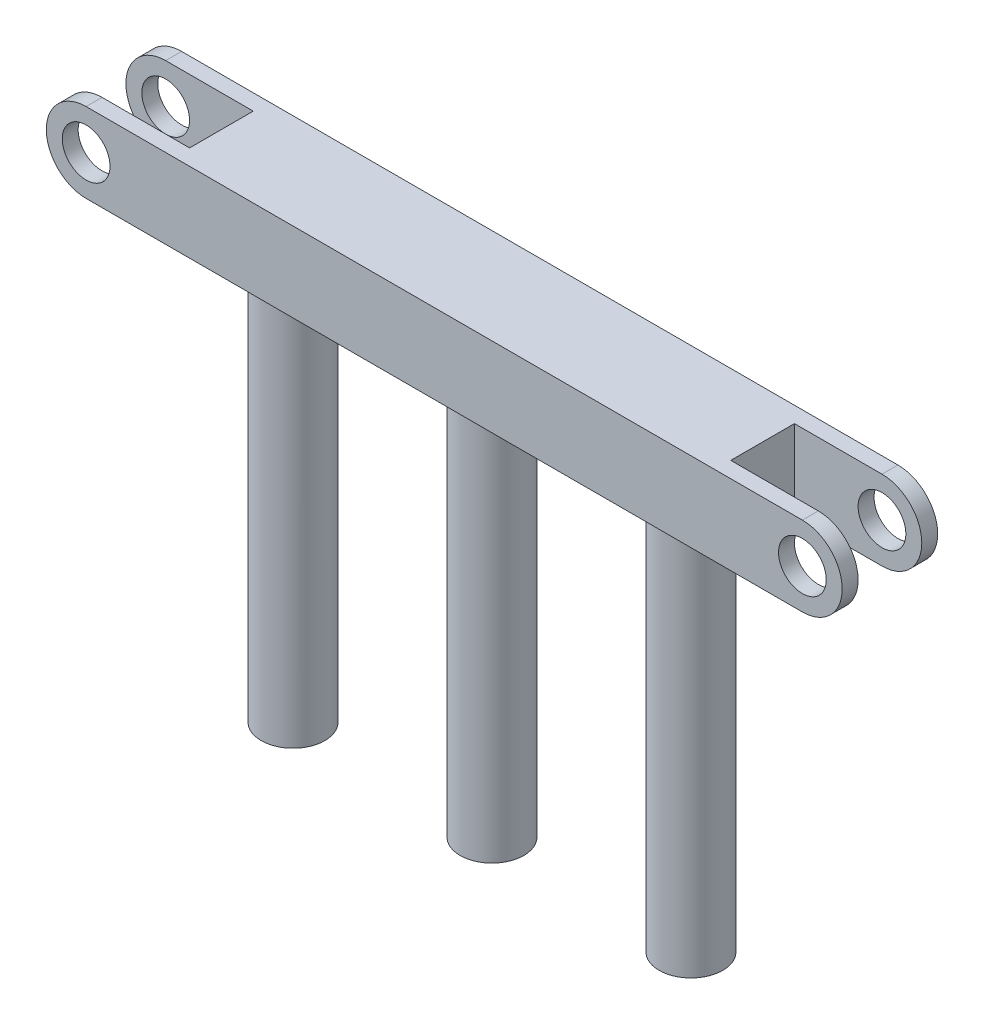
ISO-10303-21;
HEADER;
FILE_DESCRIPTION(('STEP AP214'),'2;1');
FILE_NAME('part.step','',(''),(''),'','','');
FILE_SCHEMA(('AUTOMOTIVE_DESIGN { 1 0 10303 214 1 1 1 1 }'));
ENDSEC;
DATA;
#1=APPLICATION_CONTEXT('core data for automotive mechanical design processes');
#2=APPLICATION_PROTOCOL_DEFINITION('international standard','automotive_design',2000,#1);
#3=PRODUCT_CONTEXT('',#1,'mechanical');
#4=PRODUCT('Part','Part','',(#3));
#5=PRODUCT_RELATED_PRODUCT_CATEGORY('part','',(#4));
#6=PRODUCT_DEFINITION_FORMATION('','',#4);
#7=PRODUCT_DEFINITION_CONTEXT('part definition',#1,'design');
#8=PRODUCT_DEFINITION('design','',#6,#7);
#9=PRODUCT_DEFINITION_SHAPE('','',#8);
#10=(LENGTH_UNIT() NAMED_UNIT(*) SI_UNIT(.MILLI.,.METRE.));
#11=(NAMED_UNIT(*) PLANE_ANGLE_UNIT() SI_UNIT($,.RADIAN.));
#12=(NAMED_UNIT(*) SI_UNIT($,.STERADIAN.) SOLID_ANGLE_UNIT());
#13=UNCERTAINTY_MEASURE_WITH_UNIT(LENGTH_MEASURE(1.E-05),#10,'distance_accuracy_value','');
#14=(GEOMETRIC_REPRESENTATION_CONTEXT(3) GLOBAL_UNCERTAINTY_ASSIGNED_CONTEXT((#13)) GLOBAL_UNIT_ASSIGNED_CONTEXT((#10,
#11,#12)) REPRESENTATION_CONTEXT('',''));
#15=CARTESIAN_POINT('',(0.,0.,0.));
#16=DIRECTION('',(0.,0.,1.));
#17=DIRECTION('',(1.,0.,0.));
#18=AXIS2_PLACEMENT_3D('',#15,#16,#17);
#19=CARTESIAN_POINT('',(47.5,0.,3.));
#20=DIRECTION('',(0.,0.,-1.));
#21=DIRECTION('',(-1.,0.,0.));
#22=AXIS2_PLACEMENT_3D('',#19,#20,#21);
#23=CYLINDRICAL_SURFACE('',#22,2.5);
#24=CARTESIAN_POINT('',(47.5,0.,2.));
#25=DIRECTION('',(0.,0.,1.));
#26=DIRECTION('',(1.,0.,0.));
#27=AXIS2_PLACEMENT_3D('',#24,#25,#26);
#28=CIRCLE('',#27,2.5);
#29=CARTESIAN_POINT('',(47.5,2.5,2.));
#30=VERTEX_POINT('',#29);
#31=CARTESIAN_POINT('',(47.5,-2.5,2.));
#32=VERTEX_POINT('',#31);
#33=EDGE_CURVE('E157',#30,#32,#28,.F.);
#34=ORIENTED_EDGE('',*,*,#33,.F.);
#35=DIRECTION('',(0.,0.,-1.));
#36=VECTOR('',#35,1.);
#37=CARTESIAN_POINT('',(47.5,2.5,3.));
#38=LINE('',#37,#36);
#39=CARTESIAN_POINT('',(47.5,2.5,3.));
#40=VERTEX_POINT('',#39);
#41=EDGE_CURVE('E208',#40,#30,#38,.T.);
#42=ORIENTED_EDGE('',*,*,#41,.F.);
#43=CARTESIAN_POINT('',(47.5,0.,3.));
#44=DIRECTION('',(0.,0.,1.));
#45=DIRECTION('',(1.,0.,0.));
#46=AXIS2_PLACEMENT_3D('',#43,#44,#45);
#47=CIRCLE('',#46,2.5);
#48=CARTESIAN_POINT('',(47.5,-2.5,3.));
#49=VERTEX_POINT('',#48);
#50=EDGE_CURVE('E214',#49,#40,#47,.T.);
#51=ORIENTED_EDGE('',*,*,#50,.F.);
#52=DIRECTION('',(0.,0.,-1.));
#53=VECTOR('',#52,1.);
#54=CARTESIAN_POINT('',(47.5,-2.5,3.));
#55=LINE('',#54,#53);
#56=EDGE_CURVE('E210',#32,#49,#55,.F.);
#57=ORIENTED_EDGE('',*,*,#56,.F.);
#58=EDGE_LOOP('',(#34,#42,#51,#57));
#59=FACE_BOUND('',#58,.T.);
#60=ADVANCED_FACE('F33',(#59),#23,.T.);
#61=CARTESIAN_POINT('',(47.5,0.,-3.));
#62=DIRECTION('',(0.,0.,1.));
#63=DIRECTION('',(1.,0.,0.));
#64=AXIS2_PLACEMENT_3D('',#61,#62,#63);
#65=CYLINDRICAL_SURFACE('',#64,1.5);
#66=CARTESIAN_POINT('',(47.5,0.,2.));
#67=DIRECTION('',(0.,0.,1.));
#68=DIRECTION('',(1.,0.,0.));
#69=AXIS2_PLACEMENT_3D('',#66,#67,#68);
#70=CIRCLE('',#69,1.5);
#71=CARTESIAN_POINT('',(49.,0.,2.));
#72=VERTEX_POINT('',#71);
#73=EDGE_CURVE('E37',#72,#72,#70,.F.);
#74=ORIENTED_EDGE('',*,*,#73,.T.);
#75=EDGE_LOOP('',(#74));
#76=FACE_BOUND('',#75,.T.);
#77=CARTESIAN_POINT('',(47.5,0.,3.));
#78=DIRECTION('',(0.,0.,1.));
#79=DIRECTION('',(1.,0.,0.));
#80=AXIS2_PLACEMENT_3D('',#77,#78,#79);
#81=CIRCLE('',#80,1.5);
#82=CARTESIAN_POINT('',(49.,0.,3.));
#83=VERTEX_POINT('',#82);
#84=EDGE_CURVE('E184',#83,#83,#81,.T.);
#85=ORIENTED_EDGE('',*,*,#84,.T.);
#86=EDGE_LOOP('',(#85));
#87=FACE_BOUND('',#86,.T.);
#88=ADVANCED_FACE('F249',(#76,#87),#65,.F.);
#89=CARTESIAN_POINT('',(2.5,0.,-3.));
#90=DIRECTION('',(0.,0.,-1.));
#91=DIRECTION('',(-1.,0.,0.));
#92=AXIS2_PLACEMENT_3D('',#89,#90,#91);
#93=CYLINDRICAL_SURFACE('',#92,2.5);
#94=CARTESIAN_POINT('',(2.5,0.,2.));
#95=DIRECTION('',(0.,0.,1.));
#96=DIRECTION('',(1.,0.,0.));
#97=AXIS2_PLACEMENT_3D('',#94,#95,#96);
#98=CIRCLE('',#97,2.5);
#99=CARTESIAN_POINT('',(2.5,-2.5,2.));
#100=VERTEX_POINT('',#99);
#101=CARTESIAN_POINT('',(2.5,2.5,2.));
#102=VERTEX_POINT('',#101);
#103=EDGE_CURVE('E182',#100,#102,#98,.F.);
#104=ORIENTED_EDGE('',*,*,#103,.F.);
#105=DIRECTION('',(0.,0.,-1.));
#106=VECTOR('',#105,1.);
#107=CARTESIAN_POINT('',(2.5,-2.5,3.));
#108=LINE('',#107,#106);
#109=CARTESIAN_POINT('',(2.5,-2.5,3.));
#110=VERTEX_POINT('',#109);
#111=EDGE_CURVE('E224',#110,#100,#108,.T.);
#112=ORIENTED_EDGE('',*,*,#111,.F.);
#113=CARTESIAN_POINT('',(2.5,0.,3.));
#114=DIRECTION('',(0.,0.,1.));
#115=DIRECTION('',(1.,0.,0.));
#116=AXIS2_PLACEMENT_3D('',#113,#114,#115);
#117=CIRCLE('',#116,2.5);
#118=CARTESIAN_POINT('',(2.5,2.5,3.));
#119=VERTEX_POINT('',#118);
#120=EDGE_CURVE('E11',#119,#110,#117,.T.);
#121=ORIENTED_EDGE('',*,*,#120,.F.);
#122=DIRECTION('',(0.,0.,-1.));
#123=VECTOR('',#122,1.);
#124=CARTESIAN_POINT('',(2.5,2.5,3.));
#125=LINE('',#124,#123);
#126=EDGE_CURVE('E219',#102,#119,#125,.F.);
#127=ORIENTED_EDGE('',*,*,#126,.F.);
#128=EDGE_LOOP('',(#104,#112,#121,#127));
#129=FACE_BOUND('',#128,.T.);
#130=ADVANCED_FACE('F255',(#129),#93,.T.);
#131=CARTESIAN_POINT('',(2.5,0.,-3.));
#132=DIRECTION('',(0.,0.,1.));
#133=DIRECTION('',(1.,0.,0.));
#134=AXIS2_PLACEMENT_3D('',#131,#132,#133);
#135=CYLINDRICAL_SURFACE('',#134,1.5);
#136=CARTESIAN_POINT('',(2.5,0.,2.));
#137=DIRECTION('',(0.,0.,1.));
#138=DIRECTION('',(1.,0.,0.));
#139=AXIS2_PLACEMENT_3D('',#136,#137,#138);
#140=CIRCLE('',#139,1.5);
#141=CARTESIAN_POINT('',(4.,0.,2.));
#142=VERTEX_POINT('',#141);
#143=EDGE_CURVE('E181',#142,#142,#140,.F.);
#144=ORIENTED_EDGE('',*,*,#143,.T.);
#145=EDGE_LOOP('',(#144));
#146=FACE_BOUND('',#145,.T.);
#147=CARTESIAN_POINT('',(2.5,0.,3.));
#148=DIRECTION('',(0.,0.,1.));
#149=DIRECTION('',(1.,0.,0.));
#150=AXIS2_PLACEMENT_3D('',#147,#148,#149);
#151=CIRCLE('',#150,1.5);
#152=CARTESIAN_POINT('',(4.,0.,3.));
#153=VERTEX_POINT('',#152);
#154=EDGE_CURVE('E190',#153,#153,#151,.T.);
#155=ORIENTED_EDGE('',*,*,#154,.T.);
#156=EDGE_LOOP('',(#155));
#157=FACE_BOUND('',#156,.T.);
#158=ADVANCED_FACE('F267',(#146,#157),#135,.F.);
#159=CARTESIAN_POINT('',(2.5,0.,-2.));
#160=DIRECTION('',(0.,0.,-1.));
#161=DIRECTION('',(-1.,0.,0.));
#162=AXIS2_PLACEMENT_3D('',#159,#160,#161);
#163=CIRCLE('',#162,2.5);
#164=CARTESIAN_POINT('',(2.5,2.5,-2.));
#165=VERTEX_POINT('',#164);
#166=CARTESIAN_POINT('',(2.5,-2.5,-2.));
#167=VERTEX_POINT('',#166);
#168=EDGE_CURVE('E179',#165,#167,#163,.F.);
#169=ORIENTED_EDGE('',*,*,#168,.F.);
#170=CARTESIAN_POINT('',(2.5,2.5,-3.));
#171=VERTEX_POINT('',#170);
#172=EDGE_CURVE('E220',#171,#165,#125,.F.);
#173=ORIENTED_EDGE('',*,*,#172,.F.);
#174=CARTESIAN_POINT('',(2.5,0.,-3.));
#175=DIRECTION('',(0.,0.,1.));
#176=DIRECTION('',(1.,0.,0.));
#177=AXIS2_PLACEMENT_3D('',#174,#175,#176);
#178=CIRCLE('',#177,2.5);
#179=CARTESIAN_POINT('',(2.5,-2.5,-3.));
#180=VERTEX_POINT('',#179);
#181=EDGE_CURVE('E42',#180,#171,#178,.F.);
#182=ORIENTED_EDGE('',*,*,#181,.F.);
#183=EDGE_CURVE('E223',#167,#180,#108,.T.);
#184=ORIENTED_EDGE('',*,*,#183,.F.);
#185=EDGE_LOOP('',(#169,#173,#182,#184));
#186=FACE_BOUND('',#185,.T.);
#187=ADVANCED_FACE('F35',(#186),#93,.T.);
#188=CARTESIAN_POINT('',(47.5,0.,-2.));
#189=DIRECTION('',(0.,0.,-1.));
#190=DIRECTION('',(-1.,0.,0.));
#191=AXIS2_PLACEMENT_3D('',#188,#189,#190);
#192=CIRCLE('',#191,2.5);
#193=CARTESIAN_POINT('',(47.5,-2.5,-2.));
#194=VERTEX_POINT('',#193);
#195=CARTESIAN_POINT('',(47.5,2.5,-2.));
#196=VERTEX_POINT('',#195);
#197=EDGE_CURVE('E50',#194,#196,#192,.F.);
#198=ORIENTED_EDGE('',*,*,#197,.F.);
#199=CARTESIAN_POINT('',(47.5,-2.5,-3.));
#200=VERTEX_POINT('',#199);
#201=EDGE_CURVE('E211',#200,#194,#55,.F.);
#202=ORIENTED_EDGE('',*,*,#201,.F.);
#203=CARTESIAN_POINT('',(47.5,0.,-3.));
#204=DIRECTION('',(0.,0.,1.));
#205=DIRECTION('',(1.,0.,0.));
#206=AXIS2_PLACEMENT_3D('',#203,#204,#205);
#207=CIRCLE('',#206,2.5);
#208=CARTESIAN_POINT('',(47.5,2.5,-3.));
#209=VERTEX_POINT('',#208);
#210=EDGE_CURVE('E216',#209,#200,#207,.F.);
#211=ORIENTED_EDGE('',*,*,#210,.F.);
#212=EDGE_CURVE('E207',#196,#209,#38,.T.);
#213=ORIENTED_EDGE('',*,*,#212,.F.);
#214=EDGE_LOOP('',(#198,#202,#211,#213));
#215=FACE_BOUND('',#214,.T.);
#216=ADVANCED_FACE('F251',(#215),#23,.T.);
#217=CARTESIAN_POINT('',(0.,-2.5,3.));
#218=DIRECTION('',(0.,1.,0.));
#219=DIRECTION('',(0.,0.,1.));
#220=AXIS2_PLACEMENT_3D('',#217,#218,#219);
#221=PLANE('',#220);
#222=CARTESIAN_POINT('',(25.,-2.5,0.));
#223=DIRECTION('',(0.,1.,0.));
#224=DIRECTION('',(0.,0.,1.));
#225=AXIS2_PLACEMENT_3D('',#222,#223,#224);
#226=CIRCLE('',#225,2.);
#227=CARTESIAN_POINT('',(25.,-2.5,2.));
#228=VERTEX_POINT('',#227);
#229=EDGE_CURVE('E314',#228,#228,#226,.T.);
#230=ORIENTED_EDGE('',*,*,#229,.T.);
#231=EDGE_LOOP('',(#230));
#232=FACE_BOUND('',#231,.T.);
#233=CARTESIAN_POINT('',(12.5,-2.5,0.));
#234=DIRECTION('',(0.,1.,0.));
#235=DIRECTION('',(0.,0.,1.));
#236=AXIS2_PLACEMENT_3D('',#233,#234,#235);
#237=CIRCLE('',#236,2.);
#238=CARTESIAN_POINT('',(12.5,-2.5,2.));
#239=VERTEX_POINT('',#238);
#240=EDGE_CURVE('E308',#239,#239,#237,.T.);
#241=ORIENTED_EDGE('',*,*,#240,.T.);
#242=EDGE_LOOP('',(#241));
#243=FACE_BOUND('',#242,.T.);
#244=CARTESIAN_POINT('',(37.5,-2.5,0.));
#245=DIRECTION('',(0.,1.,0.));
#246=DIRECTION('',(0.,0.,1.));
#247=AXIS2_PLACEMENT_3D('',#244,#245,#246);
#248=CIRCLE('',#247,2.);
#249=CARTESIAN_POINT('',(37.5,-2.5,2.));
#250=VERTEX_POINT('',#249);
#251=EDGE_CURVE('E301',#250,#250,#248,.T.);
#252=ORIENTED_EDGE('',*,*,#251,.T.);
#253=EDGE_LOOP('',(#252));
#254=FACE_BOUND('',#253,.T.);
#255=DIRECTION('',(0.,0.,1.));
#256=VECTOR('',#255,1.);
#257=CARTESIAN_POINT('',(42.,-2.5,1.99999999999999));
#258=LINE('',#257,#256);
#259=CARTESIAN_POINT('',(42.,-2.5,-2.00000000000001));
#260=VERTEX_POINT('',#259);
#261=CARTESIAN_POINT('',(42.,-2.5,1.99999999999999));
#262=VERTEX_POINT('',#261);
#263=EDGE_CURVE('E138',#260,#262,#258,.T.);
#264=ORIENTED_EDGE('',*,*,#263,.T.);
#265=DIRECTION('',(1.,0.,0.));
#266=VECTOR('',#265,1.);
#267=CARTESIAN_POINT('',(42.,-2.5,1.99999999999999));
#268=LINE('',#267,#266);
#269=EDGE_CURVE('E145',#262,#32,#268,.T.);
#270=ORIENTED_EDGE('',*,*,#269,.T.);
#271=ORIENTED_EDGE('',*,*,#56,.T.);
#272=DIRECTION('',(1.,0.,0.));
#273=VECTOR('',#272,1.);
#274=CARTESIAN_POINT('',(0.,-2.5,3.));
#275=LINE('',#274,#273);
#276=EDGE_CURVE('E201',#110,#49,#275,.T.);
#277=ORIENTED_EDGE('',*,*,#276,.F.);
#278=ORIENTED_EDGE('',*,*,#111,.T.);
#279=DIRECTION('',(1.,0.,0.));
#280=VECTOR('',#279,1.);
#281=CARTESIAN_POINT('',(8.,-2.5,2.));
#282=LINE('',#281,#280);
#283=CARTESIAN_POINT('',(8.,-2.5,2.));
#284=VERTEX_POINT('',#283);
#285=EDGE_CURVE('E166',#100,#284,#282,.T.);
#286=ORIENTED_EDGE('',*,*,#285,.T.);
#287=DIRECTION('',(0.,0.,-1.));
#288=VECTOR('',#287,1.);
#289=CARTESIAN_POINT('',(8.,-2.5,2.));
#290=LINE('',#289,#288);
#291=CARTESIAN_POINT('',(8.,-2.5,-2.));
#292=VERTEX_POINT('',#291);
#293=EDGE_CURVE('E169',#284,#292,#290,.T.);
#294=ORIENTED_EDGE('',*,*,#293,.T.);
#295=DIRECTION('',(-1.,0.,0.));
#296=VECTOR('',#295,1.);
#297=CARTESIAN_POINT('',(8.,-2.5,-2.));
#298=LINE('',#297,#296);
#299=EDGE_CURVE('E172',#292,#167,#298,.T.);
#300=ORIENTED_EDGE('',*,*,#299,.T.);
#301=ORIENTED_EDGE('',*,*,#183,.T.);
#302=DIRECTION('',(1.,0.,0.));
#303=VECTOR('',#302,1.);
#304=CARTESIAN_POINT('',(0.,-2.5,-3.));
#305=LINE('',#304,#303);
#306=EDGE_CURVE('E196',#180,#200,#305,.T.);
#307=ORIENTED_EDGE('',*,*,#306,.T.);
#308=ORIENTED_EDGE('',*,*,#201,.T.);
#309=DIRECTION('',(-1.,0.,0.));
#310=VECTOR('',#309,1.);
#311=CARTESIAN_POINT('',(42.,-2.5,-2.00000000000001));
#312=LINE('',#311,#310);
#313=EDGE_CURVE('E148',#194,#260,#312,.T.);
#314=ORIENTED_EDGE('',*,*,#313,.T.);
#315=EDGE_LOOP('',(#264,#270,#271,#277,#278,#286,#294,#300,#301,#307,#308,#314));
#316=FACE_BOUND('',#315,.T.);
#317=ADVANCED_FACE('F260',(#232,#243,#254,#316),#221,.F.);
#318=CARTESIAN_POINT('',(0.,2.5,3.));
#319=DIRECTION('',(0.,-1.,0.));
#320=DIRECTION('',(0.,0.,-1.));
#321=AXIS2_PLACEMENT_3D('',#318,#319,#320);
#322=PLANE('',#321);
#323=ORIENTED_EDGE('',*,*,#41,.T.);
#324=DIRECTION('',(1.,0.,0.));
#325=VECTOR('',#324,1.);
#326=CARTESIAN_POINT('',(42.,2.5,1.99999999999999));
#327=LINE('',#326,#325);
#328=CARTESIAN_POINT('',(42.,2.5,1.99999999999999));
#329=VERTEX_POINT('',#328);
#330=EDGE_CURVE('E131',#329,#30,#327,.T.);
#331=ORIENTED_EDGE('',*,*,#330,.F.);
#332=DIRECTION('',(0.,0.,1.));
#333=VECTOR('',#332,1.);
#334=CARTESIAN_POINT('',(42.,2.5,1.99999999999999));
#335=LINE('',#334,#333);
#336=CARTESIAN_POINT('',(42.,2.5,-2.00000000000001));
#337=VERTEX_POINT('',#336);
#338=EDGE_CURVE('E130',#337,#329,#335,.T.);
#339=ORIENTED_EDGE('',*,*,#338,.F.);
#340=DIRECTION('',(-1.,0.,0.));
#341=VECTOR('',#340,1.);
#342=CARTESIAN_POINT('',(42.,2.5,-2.00000000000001));
#343=LINE('',#342,#341);
#344=EDGE_CURVE('E121',#196,#337,#343,.T.);
#345=ORIENTED_EDGE('',*,*,#344,.F.);
#346=ORIENTED_EDGE('',*,*,#212,.T.);
#347=DIRECTION('',(-1.,0.,0.));
#348=VECTOR('',#347,1.);
#349=CARTESIAN_POINT('',(0.,2.5,-3.));
#350=LINE('',#349,#348);
#351=EDGE_CURVE('E198',#209,#171,#350,.T.);
#352=ORIENTED_EDGE('',*,*,#351,.T.);
#353=ORIENTED_EDGE('',*,*,#172,.T.);
#354=DIRECTION('',(-1.,0.,0.));
#355=VECTOR('',#354,1.);
#356=CARTESIAN_POINT('',(8.,2.5,-2.));
#357=LINE('',#356,#355);
#358=CARTESIAN_POINT('',(8.,2.5,-2.));
#359=VERTEX_POINT('',#358);
#360=EDGE_CURVE('E163',#359,#165,#357,.T.);
#361=ORIENTED_EDGE('',*,*,#360,.F.);
#362=DIRECTION('',(0.,0.,-1.));
#363=VECTOR('',#362,1.);
#364=CARTESIAN_POINT('',(8.,2.5,2.));
#365=LINE('',#364,#363);
#366=CARTESIAN_POINT('',(8.,2.5,2.));
#367=VERTEX_POINT('',#366);
#368=EDGE_CURVE('E161',#367,#359,#365,.T.);
#369=ORIENTED_EDGE('',*,*,#368,.F.);
#370=DIRECTION('',(1.,0.,0.));
#371=VECTOR('',#370,1.);
#372=CARTESIAN_POINT('',(8.,2.5,2.));
#373=LINE('',#372,#371);
#374=EDGE_CURVE('E159',#102,#367,#373,.T.);
#375=ORIENTED_EDGE('',*,*,#374,.F.);
#376=ORIENTED_EDGE('',*,*,#126,.T.);
#377=DIRECTION('',(-1.,0.,0.));
#378=VECTOR('',#377,1.);
#379=CARTESIAN_POINT('',(0.,2.5,3.));
#380=LINE('',#379,#378);
#381=EDGE_CURVE('E204',#40,#119,#380,.T.);
#382=ORIENTED_EDGE('',*,*,#381,.F.);
#383=EDGE_LOOP('',(#323,#331,#339,#345,#346,#352,#353,#361,#369,#375,#376,#382));
#384=FACE_BOUND('',#383,.T.);
#385=ADVANCED_FACE('F143',(#384),#322,.F.);
#386=CARTESIAN_POINT('',(0.,-2.5,3.));
#387=DIRECTION('',(0.,0.,1.));
#388=DIRECTION('',(1.,0.,0.));
#389=AXIS2_PLACEMENT_3D('',#386,#387,#388);
#390=PLANE('',#389);
#391=ORIENTED_EDGE('',*,*,#84,.F.);
#392=EDGE_LOOP('',(#391));
#393=FACE_BOUND('',#392,.T.);
#394=ORIENTED_EDGE('',*,*,#154,.F.);
#395=EDGE_LOOP('',(#394));
#396=FACE_BOUND('',#395,.T.);
#397=ORIENTED_EDGE('',*,*,#381,.T.);
#398=ORIENTED_EDGE('',*,*,#120,.T.);
#399=ORIENTED_EDGE('',*,*,#276,.T.);
#400=ORIENTED_EDGE('',*,*,#50,.T.);
#401=EDGE_LOOP('',(#397,#398,#399,#400));
#402=FACE_BOUND('',#401,.T.);
#403=ADVANCED_FACE('F295',(#393,#396,#402),#390,.T.);
#404=CARTESIAN_POINT('',(0.,-2.5,-3.));
#405=DIRECTION('',(0.,0.,1.));
#406=DIRECTION('',(1.,0.,0.));
#407=AXIS2_PLACEMENT_3D('',#404,#405,#406);
#408=PLANE('',#407);
#409=CARTESIAN_POINT('',(47.5,0.,-3.));
#410=DIRECTION('',(0.,0.,1.));
#411=DIRECTION('',(1.,0.,0.));
#412=AXIS2_PLACEMENT_3D('',#409,#410,#411);
#413=CIRCLE('',#412,1.5);
#414=CARTESIAN_POINT('',(49.,0.,-3.));
#415=VERTEX_POINT('',#414);
#416=EDGE_CURVE('E187',#415,#415,#413,.T.);
#417=ORIENTED_EDGE('',*,*,#416,.T.);
#418=EDGE_LOOP('',(#417));
#419=FACE_BOUND('',#418,.T.);
#420=CARTESIAN_POINT('',(2.5,0.,-3.));
#421=DIRECTION('',(0.,0.,1.));
#422=DIRECTION('',(1.,0.,0.));
#423=AXIS2_PLACEMENT_3D('',#420,#421,#422);
#424=CIRCLE('',#423,1.5);
#425=CARTESIAN_POINT('',(4.,0.,-3.));
#426=VERTEX_POINT('',#425);
#427=EDGE_CURVE('E193',#426,#426,#424,.T.);
#428=ORIENTED_EDGE('',*,*,#427,.T.);
#429=EDGE_LOOP('',(#428));
#430=FACE_BOUND('',#429,.T.);
#431=ORIENTED_EDGE('',*,*,#306,.F.);
#432=ORIENTED_EDGE('',*,*,#181,.T.);
#433=ORIENTED_EDGE('',*,*,#351,.F.);
#434=ORIENTED_EDGE('',*,*,#210,.T.);
#435=EDGE_LOOP('',(#431,#432,#433,#434));
#436=FACE_BOUND('',#435,.T.);
#437=ADVANCED_FACE('F277',(#419,#430,#436),#408,.F.);
#438=CARTESIAN_POINT('',(2.5,0.,-2.));
#439=DIRECTION('',(0.,0.,-1.));
#440=DIRECTION('',(-1.,0.,0.));
#441=AXIS2_PLACEMENT_3D('',#438,#439,#440);
#442=CIRCLE('',#441,1.5);
#443=CARTESIAN_POINT('',(1.00000000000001,0.,-2.));
#444=VERTEX_POINT('',#443);
#445=EDGE_CURVE('E177',#444,#444,#442,.F.);
#446=ORIENTED_EDGE('',*,*,#445,.T.);
#447=EDGE_LOOP('',(#446));
#448=FACE_BOUND('',#447,.T.);
#449=ORIENTED_EDGE('',*,*,#427,.F.);
#450=EDGE_LOOP('',(#449));
#451=FACE_BOUND('',#450,.T.);
#452=ADVANCED_FACE('F448',(#448,#451),#135,.F.);
#453=CARTESIAN_POINT('',(47.5,0.,-2.));
#454=DIRECTION('',(0.,0.,-1.));
#455=DIRECTION('',(-1.,0.,0.));
#456=AXIS2_PLACEMENT_3D('',#453,#454,#455);
#457=CIRCLE('',#456,1.5);
#458=CARTESIAN_POINT('',(46.,0.,-2.));
#459=VERTEX_POINT('',#458);
#460=EDGE_CURVE('E154',#459,#459,#457,.F.);
#461=ORIENTED_EDGE('',*,*,#460,.T.);
#462=EDGE_LOOP('',(#461));
#463=FACE_BOUND('',#462,.T.);
#464=ORIENTED_EDGE('',*,*,#416,.F.);
#465=EDGE_LOOP('',(#464));
#466=FACE_BOUND('',#465,.T.);
#467=ADVANCED_FACE('F234',(#463,#466),#65,.F.);
#468=CARTESIAN_POINT('',(8.,-2.5,2.));
#469=DIRECTION('',(0.,0.,1.));
#470=DIRECTION('',(1.,0.,0.));
#471=AXIS2_PLACEMENT_3D('',#468,#469,#470);
#472=PLANE('',#471);
#473=ORIENTED_EDGE('',*,*,#103,.T.);
#474=ORIENTED_EDGE('',*,*,#374,.T.);
#475=DIRECTION('',(0.,1.,0.));
#476=VECTOR('',#475,1.);
#477=CARTESIAN_POINT('',(8.,-2.5,2.));
#478=LINE('',#477,#476);
#479=EDGE_CURVE('E58',#284,#367,#478,.T.);
#480=ORIENTED_EDGE('',*,*,#479,.F.);
#481=ORIENTED_EDGE('',*,*,#285,.F.);
#482=EDGE_LOOP('',(#473,#474,#480,#481));
#483=FACE_BOUND('',#482,.T.);
#484=ORIENTED_EDGE('',*,*,#143,.F.);
#485=EDGE_LOOP('',(#484));
#486=FACE_BOUND('',#485,.T.);
#487=ADVANCED_FACE('F414',(#483,#486),#472,.F.);
#488=CARTESIAN_POINT('',(8.,-2.5,-2.));
#489=DIRECTION('',(0.,0.,-1.));
#490=DIRECTION('',(-1.,0.,0.));
#491=AXIS2_PLACEMENT_3D('',#488,#489,#490);
#492=PLANE('',#491);
#493=ORIENTED_EDGE('',*,*,#168,.T.);
#494=ORIENTED_EDGE('',*,*,#299,.F.);
#495=DIRECTION('',(0.,1.,0.));
#496=VECTOR('',#495,1.);
#497=CARTESIAN_POINT('',(8.,-2.5,-2.));
#498=LINE('',#497,#496);
#499=EDGE_CURVE('E175',#292,#359,#498,.T.);
#500=ORIENTED_EDGE('',*,*,#499,.T.);
#501=ORIENTED_EDGE('',*,*,#360,.T.);
#502=EDGE_LOOP('',(#493,#494,#500,#501));
#503=FACE_BOUND('',#502,.T.);
#504=ORIENTED_EDGE('',*,*,#445,.F.);
#505=EDGE_LOOP('',(#504));
#506=FACE_BOUND('',#505,.T.);
#507=ADVANCED_FACE('F283',(#503,#506),#492,.F.);
#508=CARTESIAN_POINT('',(8.,-2.5,2.));
#509=DIRECTION('',(1.,0.,0.));
#510=DIRECTION('',(0.,0.,-1.));
#511=AXIS2_PLACEMENT_3D('',#508,#509,#510);
#512=PLANE('',#511);
#513=ORIENTED_EDGE('',*,*,#368,.T.);
#514=ORIENTED_EDGE('',*,*,#499,.F.);
#515=ORIENTED_EDGE('',*,*,#293,.F.);
#516=ORIENTED_EDGE('',*,*,#479,.T.);
#517=EDGE_LOOP('',(#513,#514,#515,#516));
#518=FACE_BOUND('',#517,.T.);
#519=ADVANCED_FACE('F245',(#518),#512,.F.);
#520=CARTESIAN_POINT('',(42.,-2.5,1.99999999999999));
#521=DIRECTION('',(0.,0.,1.));
#522=DIRECTION('',(1.,0.,0.));
#523=AXIS2_PLACEMENT_3D('',#520,#521,#522);
#524=PLANE('',#523);
#525=ORIENTED_EDGE('',*,*,#33,.T.);
#526=ORIENTED_EDGE('',*,*,#269,.F.);
#527=DIRECTION('',(0.,1.,0.));
#528=VECTOR('',#527,1.);
#529=CARTESIAN_POINT('',(42.,-2.5,1.99999999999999));
#530=LINE('',#529,#528);
#531=EDGE_CURVE('E140',#262,#329,#530,.T.);
#532=ORIENTED_EDGE('',*,*,#531,.T.);
#533=ORIENTED_EDGE('',*,*,#330,.T.);
#534=EDGE_LOOP('',(#525,#526,#532,#533));
#535=FACE_BOUND('',#534,.T.);
#536=ORIENTED_EDGE('',*,*,#73,.F.);
#537=EDGE_LOOP('',(#536));
#538=FACE_BOUND('',#537,.T.);
#539=ADVANCED_FACE('F237',(#535,#538),#524,.F.);
#540=CARTESIAN_POINT('',(42.,-2.5,-2.00000000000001));
#541=DIRECTION('',(0.,0.,-1.));
#542=DIRECTION('',(-1.,0.,0.));
#543=AXIS2_PLACEMENT_3D('',#540,#541,#542);
#544=PLANE('',#543);
#545=ORIENTED_EDGE('',*,*,#197,.T.);
#546=ORIENTED_EDGE('',*,*,#344,.T.);
#547=DIRECTION('',(0.,1.,0.));
#548=VECTOR('',#547,1.);
#549=CARTESIAN_POINT('',(42.,-2.5,-2.00000000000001));
#550=LINE('',#549,#548);
#551=EDGE_CURVE('E125',#260,#337,#550,.T.);
#552=ORIENTED_EDGE('',*,*,#551,.F.);
#553=ORIENTED_EDGE('',*,*,#313,.F.);
#554=EDGE_LOOP('',(#545,#546,#552,#553));
#555=FACE_BOUND('',#554,.T.);
#556=ORIENTED_EDGE('',*,*,#460,.F.);
#557=EDGE_LOOP('',(#556));
#558=FACE_BOUND('',#557,.T.);
#559=ADVANCED_FACE('F123',(#555,#558),#544,.F.);
#560=CARTESIAN_POINT('',(42.,-2.5,1.99999999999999));
#561=DIRECTION('',(-1.,0.,0.));
#562=DIRECTION('',(0.,0.,1.));
#563=AXIS2_PLACEMENT_3D('',#560,#561,#562);
#564=PLANE('',#563);
#565=ORIENTED_EDGE('',*,*,#338,.T.);
#566=ORIENTED_EDGE('',*,*,#531,.F.);
#567=ORIENTED_EDGE('',*,*,#263,.F.);
#568=ORIENTED_EDGE('',*,*,#551,.T.);
#569=EDGE_LOOP('',(#565,#566,#567,#568));
#570=FACE_BOUND('',#569,.T.);
#571=ADVANCED_FACE('F135',(#570),#564,.F.);
#572=CARTESIAN_POINT('',(37.5,-27.5,0.));
#573=DIRECTION('',(0.,1.,0.));
#574=DIRECTION('',(0.,0.,1.));
#575=AXIS2_PLACEMENT_3D('',#572,#573,#574);
#576=CYLINDRICAL_SURFACE('',#575,2.);
#577=CARTESIAN_POINT('',(37.5,-27.5,0.));
#578=DIRECTION('',(0.,1.,0.));
#579=DIRECTION('',(0.,0.,1.));
#580=AXIS2_PLACEMENT_3D('',#577,#578,#579);
#581=CIRCLE('',#580,2.);
#582=CARTESIAN_POINT('',(37.5,-27.5,2.));
#583=VERTEX_POINT('',#582);
#584=EDGE_CURVE('E303',#583,#583,#581,.T.);
#585=ORIENTED_EDGE('',*,*,#584,.T.);
#586=EDGE_LOOP('',(#585));
#587=FACE_BOUND('',#586,.T.);
#588=ORIENTED_EDGE('',*,*,#251,.F.);
#589=EDGE_LOOP('',(#588));
#590=FACE_BOUND('',#589,.T.);
#591=ADVANCED_FACE('F243',(#587,#590),#576,.T.);
#592=CARTESIAN_POINT('',(37.5,-27.5,0.));
#593=DIRECTION('',(0.,1.,0.));
#594=DIRECTION('',(0.,0.,1.));
#595=AXIS2_PLACEMENT_3D('',#592,#593,#594);
#596=PLANE('',#595);
#597=ORIENTED_EDGE('',*,*,#584,.F.);
#598=EDGE_LOOP('',(#597));
#599=FACE_BOUND('',#598,.T.);
#600=ADVANCED_FACE('F339',(#599),#596,.F.);
#601=CARTESIAN_POINT('',(12.5,-27.5,0.));
#602=DIRECTION('',(0.,1.,0.));
#603=DIRECTION('',(0.,0.,1.));
#604=AXIS2_PLACEMENT_3D('',#601,#602,#603);
#605=CYLINDRICAL_SURFACE('',#604,2.);
#606=CARTESIAN_POINT('',(12.5,-27.5,0.));
#607=DIRECTION('',(0.,1.,0.));
#608=DIRECTION('',(0.,0.,-1.));
#609=AXIS2_PLACEMENT_3D('',#606,#607,#608);
#610=CIRCLE('',#609,2.);
#611=CARTESIAN_POINT('',(12.5,-27.5,-2.));
#612=VERTEX_POINT('',#611);
#613=EDGE_CURVE('E311',#612,#612,#610,.T.);
#614=ORIENTED_EDGE('',*,*,#613,.T.);
#615=EDGE_LOOP('',(#614));
#616=FACE_BOUND('',#615,.T.);
#617=ORIENTED_EDGE('',*,*,#240,.F.);
#618=EDGE_LOOP('',(#617));
#619=FACE_BOUND('',#618,.T.);
#620=ADVANCED_FACE('F335',(#616,#619),#605,.T.);
#621=CARTESIAN_POINT('',(12.5,-27.5,0.));
#622=DIRECTION('',(0.,-1.,0.));
#623=DIRECTION('',(0.,0.,-1.));
#624=AXIS2_PLACEMENT_3D('',#621,#622,#623);
#625=PLANE('',#624);
#626=ORIENTED_EDGE('',*,*,#613,.F.);
#627=EDGE_LOOP('',(#626));
#628=FACE_BOUND('',#627,.T.);
#629=ADVANCED_FACE('F330',(#628),#625,.T.);
#630=CARTESIAN_POINT('',(25.,-27.5,0.));
#631=DIRECTION('',(0.,1.,0.));
#632=DIRECTION('',(0.,0.,1.));
#633=AXIS2_PLACEMENT_3D('',#630,#631,#632);
#634=CYLINDRICAL_SURFACE('',#633,2.);
#635=CARTESIAN_POINT('',(25.,-27.5,0.));
#636=DIRECTION('',(0.,1.,0.));
#637=DIRECTION('',(0.,0.,1.));
#638=AXIS2_PLACEMENT_3D('',#635,#636,#637);
#639=CIRCLE('',#638,2.);
#640=CARTESIAN_POINT('',(25.,-27.5,2.));
#641=VERTEX_POINT('',#640);
#642=EDGE_CURVE('E317',#641,#641,#639,.T.);
#643=ORIENTED_EDGE('',*,*,#642,.T.);
#644=EDGE_LOOP('',(#643));
#645=FACE_BOUND('',#644,.T.);
#646=ORIENTED_EDGE('',*,*,#229,.F.);
#647=EDGE_LOOP('',(#646));
#648=FACE_BOUND('',#647,.T.);
#649=ADVANCED_FACE('F321',(#645,#648),#634,.T.);
#650=CARTESIAN_POINT('',(25.,-27.5,0.));
#651=DIRECTION('',(0.,1.,0.));
#652=DIRECTION('',(0.,0.,1.));
#653=AXIS2_PLACEMENT_3D('',#650,#651,#652);
#654=PLANE('',#653);
#655=ORIENTED_EDGE('',*,*,#642,.F.);
#656=EDGE_LOOP('',(#655));
#657=FACE_BOUND('',#656,.T.);
#658=ADVANCED_FACE('F324',(#657),#654,.F.);
#659=CLOSED_SHELL('',(#60,#88,#130,#158,#187,#216,#317,#385,#403,#437,#452,#467,#487,#507,#519,
#539,#559,#571,#591,#600,#620,#629,#649,#658));
#660=MANIFOLD_SOLID_BREP('B2',#659);
#661=ADVANCED_BREP_SHAPE_REPRESENTATION('',(#18,#660),#14);
#662=SHAPE_DEFINITION_REPRESENTATION(#9,#661);
ENDSEC;
END-ISO-10303-21;
